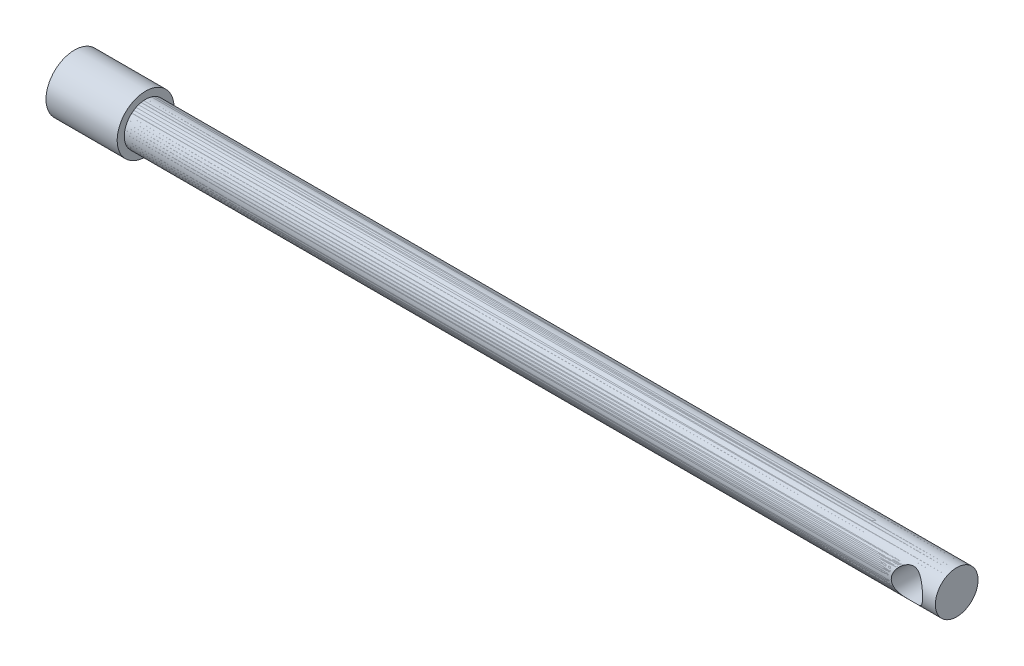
ISO-10303-21;
HEADER;
FILE_DESCRIPTION(('STEP AP214'),'2;1');
FILE_NAME('part.step','',(''),(''),'','','');
FILE_SCHEMA(('AUTOMOTIVE_DESIGN { 1 0 10303 214 1 1 1 1 }'));
ENDSEC;
DATA;
#1=APPLICATION_CONTEXT('core data for automotive mechanical design processes');
#2=APPLICATION_PROTOCOL_DEFINITION('international standard','automotive_design',2000,#1);
#3=PRODUCT_CONTEXT('',#1,'mechanical');
#4=PRODUCT('Part','Part','',(#3));
#5=PRODUCT_RELATED_PRODUCT_CATEGORY('part','',(#4));
#6=PRODUCT_DEFINITION_FORMATION('','',#4);
#7=PRODUCT_DEFINITION_CONTEXT('part definition',#1,'design');
#8=PRODUCT_DEFINITION('design','',#6,#7);
#9=PRODUCT_DEFINITION_SHAPE('','',#8);
#10=(LENGTH_UNIT() NAMED_UNIT(*) SI_UNIT(.MILLI.,.METRE.));
#11=(NAMED_UNIT(*) PLANE_ANGLE_UNIT() SI_UNIT($,.RADIAN.));
#12=(NAMED_UNIT(*) SI_UNIT($,.STERADIAN.) SOLID_ANGLE_UNIT());
#13=UNCERTAINTY_MEASURE_WITH_UNIT(LENGTH_MEASURE(1.E-05),#10,'distance_accuracy_value','');
#14=(GEOMETRIC_REPRESENTATION_CONTEXT(3) GLOBAL_UNCERTAINTY_ASSIGNED_CONTEXT((#13)) GLOBAL_UNIT_ASSIGNED_CONTEXT((#10,
#11,#12)) REPRESENTATION_CONTEXT('',''));
#15=CARTESIAN_POINT('',(0.,0.,0.));
#16=DIRECTION('',(0.,0.,1.));
#17=DIRECTION('',(1.,0.,0.));
#18=AXIS2_PLACEMENT_3D('',#15,#16,#17);
#19=CARTESIAN_POINT('',(20.0000000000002,0.,0.));
#20=DIRECTION('',(-1.,0.,0.));
#21=DIRECTION('',(0.,0.,1.));
#22=AXIS2_PLACEMENT_3D('',#19,#20,#21);
#23=CYLINDRICAL_SURFACE('',#22,15.);
#24=CARTESIAN_POINT('',(20.0000000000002,0.,0.));
#25=DIRECTION('',(-1.,0.,0.));
#26=DIRECTION('',(0.,0.,1.));
#27=AXIS2_PLACEMENT_3D('',#24,#25,#26);
#28=CIRCLE('',#27,15.);
#29=CARTESIAN_POINT('',(20.0000000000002,0.,15.));
#30=VERTEX_POINT('',#29);
#31=EDGE_CURVE('P0_E37',#30,#30,#28,.T.);
#32=ORIENTED_EDGE('',*,*,#31,.T.);
#33=EDGE_LOOP('',(#32));
#34=FACE_BOUND('',#33,.T.);
#35=CARTESIAN_POINT('',(-10.9999999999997,0.,15.));
#36=CARTESIAN_POINT('',(-10.9999989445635,0.270234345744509,14.9999989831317));
#37=CARTESIAN_POINT('',(-10.9900265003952,0.5404852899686,14.9926814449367));
#38=CARTESIAN_POINT('',(-10.9502959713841,1.07885095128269,14.963582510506));
#39=CARTESIAN_POINT('',(-10.9205289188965,1.34696464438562,14.9417945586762));
#40=CARTESIAN_POINT('',(-10.8416275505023,1.87926318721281,14.8842251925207));
#41=CARTESIAN_POINT('',(-10.792460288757,2.14344055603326,14.848419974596));
#42=CARTESIAN_POINT('',(-10.6755308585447,2.66544248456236,14.7636492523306));
#43=CARTESIAN_POINT('',(-10.6077705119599,2.92326766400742,14.7146850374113));
#44=CARTESIAN_POINT('',(-10.455056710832,3.42947281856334,14.6049788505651));
#45=CARTESIAN_POINT('',(-10.3702054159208,3.67789896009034,14.5443069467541));
#46=CARTESIAN_POINT('',(-10.1841148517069,4.16556445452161,14.4122135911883));
#47=CARTESIAN_POINT('',(-10.0828752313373,4.40480361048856,14.3407919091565));
#48=CARTESIAN_POINT('',(-9.8651391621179,4.87295052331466,14.1885487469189));
#49=CARTESIAN_POINT('',(-9.74865018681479,5.10186326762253,14.1077318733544));
#50=CARTESIAN_POINT('',(-9.50137535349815,5.54879477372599,13.9380072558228));
#51=CARTESIAN_POINT('',(-9.37058417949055,5.7668094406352,13.8490965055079));
#52=CARTESIAN_POINT('',(-9.08316785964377,6.2106513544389,13.6561916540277));
#53=CARTESIAN_POINT('',(-8.92527466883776,6.43538044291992,13.5515613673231));
#54=CARTESIAN_POINT('',(-8.59474679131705,6.87058994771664,13.3361895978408));
#55=CARTESIAN_POINT('',(-8.42211168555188,7.08106995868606,13.2254479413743));
#56=CARTESIAN_POINT('',(-8.06272673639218,7.48773584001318,12.9995381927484));
#57=CARTESIAN_POINT('',(-7.87595550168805,7.68389912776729,12.8843635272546));
#58=CARTESIAN_POINT('',(-7.48928883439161,8.06123556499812,12.6517037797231));
#59=CARTESIAN_POINT('',(-7.28939585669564,8.24241150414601,12.5342191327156));
#60=CARTESIAN_POINT('',(-6.83682363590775,8.62331346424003,12.2760403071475));
#61=CARTESIAN_POINT('',(-6.5814400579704,8.81979231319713,12.1352768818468));
#62=CARTESIAN_POINT('',(-6.05311944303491,9.19042440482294,11.8570571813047));
#63=CARTESIAN_POINT('',(-5.78017736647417,9.36457119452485,11.7196018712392));
#64=CARTESIAN_POINT('',(-5.21744212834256,9.68936187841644,11.4525286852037));
#65=CARTESIAN_POINT('',(-4.92766801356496,9.84003165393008,11.3229022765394));
#66=CARTESIAN_POINT('',(-4.33141573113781,10.1166556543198,11.0764421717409));
#67=CARTESIAN_POINT('',(-4.02494703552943,10.242623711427,10.9596013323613));
#68=CARTESIAN_POINT('',(-3.50094853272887,10.4303850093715,10.7804394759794));
#69=CARTESIAN_POINT('',(-3.2878225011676,10.499573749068,10.7129270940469));
#70=CARTESIAN_POINT('',(-2.85500800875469,10.6254264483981,10.5881143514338));
#71=CARTESIAN_POINT('',(-2.63532164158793,10.6820943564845,10.5308107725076));
#72=CARTESIAN_POINT('',(-2.19056026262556,10.7820819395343,10.4284147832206));
#73=CARTESIAN_POINT('',(-1.96549609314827,10.8254263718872,10.3832997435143));
#74=CARTESIAN_POINT('',(-1.51077883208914,10.8981901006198,10.3069029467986));
#75=CARTESIAN_POINT('',(-1.28112576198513,10.9276094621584,10.2756211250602));
#76=CARTESIAN_POINT('',(-0.817016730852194,10.9721120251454,10.228090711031));
#77=CARTESIAN_POINT('',(-0.582537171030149,10.9870802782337,10.2119626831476));
#78=CARTESIAN_POINT('',(-0.112548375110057,11.0019364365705,10.1959559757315));
#79=CARTESIAN_POINT('',(0.122960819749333,11.0018249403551,10.1960766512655));
#80=CARTESIAN_POINT('',(0.593049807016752,10.9865203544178,10.2125654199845));
#81=CARTESIAN_POINT('',(0.827628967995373,10.9713183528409,10.2289431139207));
#82=CARTESIAN_POINT('',(1.29374843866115,10.9261645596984,10.2771594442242));
#83=CARTESIAN_POINT('',(1.52528840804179,10.8962111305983,10.3089997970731));
#84=CARTESIAN_POINT('',(2.00856310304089,10.8181280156,10.3909399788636));
#85=CARTESIAN_POINT('',(2.25976351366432,10.7683789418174,10.4426460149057));
#86=CARTESIAN_POINT('',(2.75472374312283,10.6525201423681,10.5608080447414));
#87=CARTESIAN_POINT('',(2.99848250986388,10.5864081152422,10.6272661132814));
#88=CARTESIAN_POINT('',(3.71799960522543,10.3647718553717,10.8450088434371));
#89=CARTESIAN_POINT('',(4.18133061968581,10.1860595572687,11.0145361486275));
#90=CARTESIAN_POINT('',(4.92554456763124,9.84116811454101,11.3219366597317));
#91=CARTESIAN_POINT('',(5.21682114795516,9.68975954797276,11.4522158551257));
#92=CARTESIAN_POINT('',(5.78225957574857,9.36333004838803,11.7206082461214));
#93=CARTESIAN_POINT('',(6.0564158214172,9.18830144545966,11.8587239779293));
#94=CARTESIAN_POINT('',(6.58728128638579,8.8155015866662,12.1384232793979));
#95=CARTESIAN_POINT('',(6.84397449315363,8.61770989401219,12.2800098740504));
#96=CARTESIAN_POINT('',(7.33908375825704,8.20016329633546,12.562678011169));
#97=CARTESIAN_POINT('',(7.57750193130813,7.98041093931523,12.7037596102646));
#98=CARTESIAN_POINT('',(8.0383654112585,7.51619216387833,12.9838893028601));
#99=CARTESIAN_POINT('',(8.260540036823,7.27142254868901,13.1228811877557));
#100=CARTESIAN_POINT('',(8.68379183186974,6.76031353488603,13.3933474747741));
#101=CARTESIAN_POINT('',(8.88486659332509,6.49397168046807,13.5248210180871));
#102=CARTESIAN_POINT('',(9.26374282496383,5.94097811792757,13.7766812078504));
#103=CARTESIAN_POINT('',(9.44158119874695,5.65435975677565,13.8970853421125));
#104=CARTESIAN_POINT('',(9.77210478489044,5.061715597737,14.1237235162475));
#105=CARTESIAN_POINT('',(9.92480016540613,4.75569771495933,14.2299632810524));
#106=CARTESIAN_POINT('',(10.167112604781,4.20659794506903,14.4001660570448));
#107=CARTESIAN_POINT('',(10.2628788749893,3.96740850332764,14.4679959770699));
#108=CARTESIAN_POINT('',(10.4380921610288,3.48039642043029,14.5928058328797));
#109=CARTESIAN_POINT('',(10.5175428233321,3.23257572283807,14.649788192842));
#110=CARTESIAN_POINT('',(10.659004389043,2.73012906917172,14.7516769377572));
#111=CARTESIAN_POINT('',(10.7210502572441,2.47551789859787,14.7966075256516));
#112=CARTESIAN_POINT('',(10.8270300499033,1.96072320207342,14.8735755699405));
#113=CARTESIAN_POINT('',(10.8709713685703,1.70054199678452,14.9056182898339));
#114=CARTESIAN_POINT('',(10.9368839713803,1.20084572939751,14.953761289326));
#115=CARTESIAN_POINT('',(10.9605217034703,0.961665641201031,14.9710694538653));
#116=CARTESIAN_POINT('',(10.9920819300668,0.481661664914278,14.994190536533));
#117=CARTESIAN_POINT('',(11.0000009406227,0.240837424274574,15.0000009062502));
#118=CARTESIAN_POINT('',(10.999998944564,-0.270234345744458,14.9999989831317));
#119=CARTESIAN_POINT('',(10.9900265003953,-0.540485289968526,14.9926814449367));
#120=CARTESIAN_POINT('',(10.9502959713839,-1.0788509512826,14.963582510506));
#121=CARTESIAN_POINT('',(10.9205289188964,-1.34696464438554,14.9417945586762));
#122=CARTESIAN_POINT('',(10.8416275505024,-1.87926318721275,14.8842251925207));
#123=CARTESIAN_POINT('',(10.7924602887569,-2.1434405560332,14.8484199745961));
#124=CARTESIAN_POINT('',(10.6755308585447,-2.66544248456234,14.7636492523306));
#125=CARTESIAN_POINT('',(10.6077705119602,-2.92326766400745,14.7146850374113));
#126=CARTESIAN_POINT('',(10.4550567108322,-3.42947281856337,14.6049788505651));
#127=CARTESIAN_POINT('',(10.3702054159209,-3.67789896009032,14.5443069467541));
#128=CARTESIAN_POINT('',(10.1841148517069,-4.16556445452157,14.4122135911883));
#129=CARTESIAN_POINT('',(10.0828752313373,-4.40480361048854,14.3407919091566));
#130=CARTESIAN_POINT('',(9.86513916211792,-4.87295052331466,14.1885487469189));
#131=CARTESIAN_POINT('',(9.7486501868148,-5.10186326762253,14.1077318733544));
#132=CARTESIAN_POINT('',(9.50137535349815,-5.54879477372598,13.9380072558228));
#133=CARTESIAN_POINT('',(9.37058417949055,-5.76680944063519,13.8490965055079));
#134=CARTESIAN_POINT('',(9.08316785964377,-6.2106513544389,13.6561916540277));
#135=CARTESIAN_POINT('',(8.92527466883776,-6.43538044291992,13.5515613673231));
#136=CARTESIAN_POINT('',(8.59474679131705,-6.87058994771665,13.3361895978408));
#137=CARTESIAN_POINT('',(8.42211168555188,-7.08106995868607,13.2254479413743));
#138=CARTESIAN_POINT('',(8.06272673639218,-7.48773584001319,12.9995381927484));
#139=CARTESIAN_POINT('',(7.87595550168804,-7.6838991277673,12.8843635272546));
#140=CARTESIAN_POINT('',(7.4892888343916,-8.06123556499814,12.6517037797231));
#141=CARTESIAN_POINT('',(7.28939585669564,-8.24241150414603,12.5342191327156));
#142=CARTESIAN_POINT('',(6.83682363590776,-8.62331346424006,12.2760403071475));
#143=CARTESIAN_POINT('',(6.5814400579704,-8.81979231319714,12.1352768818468));
#144=CARTESIAN_POINT('',(6.05311944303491,-9.19042440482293,11.8570571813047));
#145=CARTESIAN_POINT('',(5.78017736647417,-9.36457119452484,11.7196018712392));
#146=CARTESIAN_POINT('',(5.21744212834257,-9.68936187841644,11.4525286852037));
#147=CARTESIAN_POINT('',(4.92766801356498,-9.84003165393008,11.3229022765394));
#148=CARTESIAN_POINT('',(4.33141573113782,-10.1166556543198,11.0764421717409));
#149=CARTESIAN_POINT('',(4.02494703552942,-10.242623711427,10.9596013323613));
#150=CARTESIAN_POINT('',(3.50094853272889,-10.4303850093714,10.7804394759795));
#151=CARTESIAN_POINT('',(3.28782250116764,-10.4995737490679,10.7129270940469));
#152=CARTESIAN_POINT('',(2.85500800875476,-10.6254264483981,10.5881143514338));
#153=CARTESIAN_POINT('',(2.63532164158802,-10.6820943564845,10.5308107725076));
#154=CARTESIAN_POINT('',(2.19056026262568,-10.7820819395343,10.4284147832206));
#155=CARTESIAN_POINT('',(1.9654960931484,-10.8254263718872,10.3832997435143));
#156=CARTESIAN_POINT('',(1.51077883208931,-10.8981901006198,10.3069029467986));
#157=CARTESIAN_POINT('',(1.28112576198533,-10.9276094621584,10.2756211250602));
#158=CARTESIAN_POINT('',(0.817016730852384,-10.9721120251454,10.228090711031));
#159=CARTESIAN_POINT('',(0.582537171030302,-10.9870802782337,10.2119626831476));
#160=CARTESIAN_POINT('',(0.112548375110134,-11.0019364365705,10.1959559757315));
#161=CARTESIAN_POINT('',(-0.122960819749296,-11.0018249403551,10.1960766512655));
#162=CARTESIAN_POINT('',(-0.593049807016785,-10.9865203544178,10.2125654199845));
#163=CARTESIAN_POINT('',(-0.827628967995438,-10.9713183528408,10.2289431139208));
#164=CARTESIAN_POINT('',(-1.29374843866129,-10.9261645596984,10.2771594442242));
#165=CARTESIAN_POINT('',(-1.52528840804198,-10.8962111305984,10.3089997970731));
#166=CARTESIAN_POINT('',(-2.00856310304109,-10.8181280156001,10.3909399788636));
#167=CARTESIAN_POINT('',(-2.25976351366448,-10.7683789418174,10.4426460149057));
#168=CARTESIAN_POINT('',(-2.75472374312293,-10.652520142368,10.5608080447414));
#169=CARTESIAN_POINT('',(-2.99848250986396,-10.5864081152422,10.6272661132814));
#170=CARTESIAN_POINT('',(-3.71799960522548,-10.3647718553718,10.8450088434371));
#171=CARTESIAN_POINT('',(-4.18133061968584,-10.1860595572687,11.0145361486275));
#172=CARTESIAN_POINT('',(-4.92554456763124,-9.84116811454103,11.3219366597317));
#173=CARTESIAN_POINT('',(-5.21682114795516,-9.68975954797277,11.4522158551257));
#174=CARTESIAN_POINT('',(-5.78225957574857,-9.36333004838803,11.7206082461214));
#175=CARTESIAN_POINT('',(-6.0564158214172,-9.18830144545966,11.8587239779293));
#176=CARTESIAN_POINT('',(-6.58728128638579,-8.81550158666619,12.1384232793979));
#177=CARTESIAN_POINT('',(-6.84397449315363,-8.61770989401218,12.2800098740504));
#178=CARTESIAN_POINT('',(-7.33908375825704,-8.20016329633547,12.5626780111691));
#179=CARTESIAN_POINT('',(-7.57750193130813,-7.98041093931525,12.7037596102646));
#180=CARTESIAN_POINT('',(-8.03836541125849,-7.51619216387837,12.9838893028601));
#181=CARTESIAN_POINT('',(-8.26054003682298,-7.27142254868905,13.1228811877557));
#182=CARTESIAN_POINT('',(-8.68379183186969,-6.76031353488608,13.3933474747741));
#183=CARTESIAN_POINT('',(-8.88486659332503,-6.49397168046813,13.524821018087));
#184=CARTESIAN_POINT('',(-9.2637428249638,-5.94097811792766,13.7766812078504));
#185=CARTESIAN_POINT('',(-9.44158119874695,-5.65435975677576,13.8970853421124));
#186=CARTESIAN_POINT('',(-9.77210478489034,-5.06171559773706,14.1237235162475));
#187=CARTESIAN_POINT('',(-9.92480016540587,-4.75569771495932,14.2299632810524));
#188=CARTESIAN_POINT('',(-10.1671126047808,-4.20659794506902,14.4001660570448));
#189=CARTESIAN_POINT('',(-10.2628788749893,-3.96740850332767,14.4679959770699));
#190=CARTESIAN_POINT('',(-10.4380921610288,-3.48039642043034,14.5928058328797));
#191=CARTESIAN_POINT('',(-10.5175428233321,-3.2325757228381,14.649788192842));
#192=CARTESIAN_POINT('',(-10.659004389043,-2.73012906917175,14.7516769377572));
#193=CARTESIAN_POINT('',(-10.7210502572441,-2.47551789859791,14.7966075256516));
#194=CARTESIAN_POINT('',(-10.8270300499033,-1.96072320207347,14.8735755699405));
#195=CARTESIAN_POINT('',(-10.8709713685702,-1.70054199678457,14.9056182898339));
#196=CARTESIAN_POINT('',(-10.9368839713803,-1.20084572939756,14.953761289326));
#197=CARTESIAN_POINT('',(-10.9605217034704,-0.961665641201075,14.9710694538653));
#198=CARTESIAN_POINT('',(-10.9920819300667,-0.481661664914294,14.994190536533));
#199=CARTESIAN_POINT('',(-11.0000009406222,-0.240837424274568,15.0000009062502));
#200=CARTESIAN_POINT('',(-10.9999999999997,0.,15.));
#201=B_SPLINE_CURVE_WITH_KNOTS('',3,(#35,#36,#37,#38,#39,#40,#41,#42,#43,#44,#45,#46,#47,#48,
#49,#50,#51,#52,#53,#54,#55,#56,#57,#58,#59,#60,#61,#62,#63,#64,#65,#66,#67,#68,#69,#70,#71,#72,
#73,#74,#75,#76,#77,#78,#79,#80,#81,#82,#83,#84,#85,#86,#87,#88,#89,#90,#91,#92,#93,#94,#95,#96,
#97,#98,#99,#100,#101,#102,#103,#104,#105,#106,#107,#108,#109,#110,#111,#112,#113,#114,#115,
#116,#117,#118,#119,#120,#121,#122,#123,#124,#125,#126,#127,#128,#129,#130,#131,#132,#133,#134,
#135,#136,#137,#138,#139,#140,#141,#142,#143,#144,#145,#146,#147,#148,#149,#150,#151,#152,#153,
#154,#155,#156,#157,#158,#159,#160,#161,#162,#163,#164,#165,#166,#167,#168,#169,#170,#171,#172,
#173,#174,#175,#176,#177,#178,#179,#180,#181,#182,#183,#184,#185,#186,#187,#188,#189,#190,#191,
#192,#193,#194,#195,#196,#197,#198,#199,#200),.UNSPECIFIED.,.T.,.F.,(4,2,2,2,2,2,2,2,2,2,2,2,2,
2,2,2,2,2,2,2,2,2,2,2,2,2,2,2,2,2,2,2,2,2,2,2,2,2,2,2,2,2,2,2,2,2,2,2,2,2,2,2,2,2,2,2,2,2,2,2,2,
2,2,2,2,2,2,2,2,2,2,2,2,2,2,2,2,2,2,2,2,2,4),(0.,0.810451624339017,1.62127066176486,
2.43347261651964,3.24559501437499,4.05299986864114,4.86042202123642,5.66744993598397,
6.47477884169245,7.35566894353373,8.23658409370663,9.11886000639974,10.000971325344,
11.0546742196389,12.10868090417,13.1615172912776,14.2137624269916,14.9152774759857,
15.6165709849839,16.3165533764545,17.0165324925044,17.7220346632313,18.4275088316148,
19.1333998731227,19.8393692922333,20.6219293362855,21.4045995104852,22.9719812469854,
24.0304577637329,25.0892788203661,26.1490580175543,27.2087143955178,28.2832214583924,
29.3578510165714,30.4307525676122,31.5032191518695,32.301720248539,33.100042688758,
33.8967496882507,34.6931309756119,35.4152591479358,36.1375473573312,36.9479989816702,
37.7588180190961,38.5710199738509,39.3831423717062,40.1905472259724,40.9979693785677,
41.8049972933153,42.6123261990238,43.493216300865,44.374131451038,45.2564073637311,
46.1385186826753,47.1922215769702,48.2462282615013,49.2990646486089,50.3513097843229,
51.0528248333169,51.7541183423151,52.4541007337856,53.1540798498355,53.8595820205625,
54.5650561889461,55.2709472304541,55.9769166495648,56.759476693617,57.5421468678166,
59.1095286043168,60.1680051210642,61.2268261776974,62.2866053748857,63.3462617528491,
64.4207688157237,65.4953983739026,66.5682999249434,67.6407665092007,68.4392676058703,
69.2375900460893,70.0342970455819,70.8306783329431,71.5528065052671,72.2750947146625),.UNSPECIFIED.);
#202=CARTESIAN_POINT('',(-10.9999999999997,0.,15.));
#203=VERTEX_POINT('',#202);
#204=EDGE_CURVE('P0_E10',#203,#203,#201,.T.);
#205=ORIENTED_EDGE('',*,*,#204,.T.);
#206=EDGE_LOOP('',(#205));
#207=FACE_BOUND('',#206,.T.);
#208=CARTESIAN_POINT('',(11.0000000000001,0.,-15.));
#209=CARTESIAN_POINT('',(10.999998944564,0.270234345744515,-14.9999989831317));
#210=CARTESIAN_POINT('',(10.9900265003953,0.54048528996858,-14.9926814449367));
#211=CARTESIAN_POINT('',(10.9502959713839,1.07885095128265,-14.963582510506));
#212=CARTESIAN_POINT('',(10.9205289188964,1.34696464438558,-14.9417945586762));
#213=CARTESIAN_POINT('',(10.8416275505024,1.87926318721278,-14.8842251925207));
#214=CARTESIAN_POINT('',(10.7924602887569,2.14344055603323,-14.848419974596));
#215=CARTESIAN_POINT('',(10.6755308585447,2.66544248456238,-14.7636492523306));
#216=CARTESIAN_POINT('',(10.6077705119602,2.92326766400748,-14.7146850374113));
#217=CARTESIAN_POINT('',(10.4550567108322,3.42947281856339,-14.6049788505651));
#218=CARTESIAN_POINT('',(10.3702054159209,3.67789896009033,-14.5443069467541));
#219=CARTESIAN_POINT('',(10.1841148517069,4.16556445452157,-14.4122135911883));
#220=CARTESIAN_POINT('',(10.0828752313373,4.40480361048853,-14.3407919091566));
#221=CARTESIAN_POINT('',(9.86513916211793,4.87295052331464,-14.1885487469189));
#222=CARTESIAN_POINT('',(9.74865018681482,5.10186326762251,-14.1077318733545));
#223=CARTESIAN_POINT('',(9.50137535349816,5.54879477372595,-13.9380072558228));
#224=CARTESIAN_POINT('',(9.37058417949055,5.76680944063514,-13.8490965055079));
#225=CARTESIAN_POINT('',(9.08316785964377,6.21065135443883,-13.6561916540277));
#226=CARTESIAN_POINT('',(8.92527466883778,6.43538044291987,-13.5515613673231));
#227=CARTESIAN_POINT('',(8.59474679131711,6.87058994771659,-13.3361895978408));
#228=CARTESIAN_POINT('',(8.42211168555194,7.081069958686,-13.2254479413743));
#229=CARTESIAN_POINT('',(8.06272673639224,7.4877358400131,-12.9995381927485));
#230=CARTESIAN_POINT('',(7.8759555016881,7.6838991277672,-12.8843635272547));
#231=CARTESIAN_POINT('',(7.48928883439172,8.06123556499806,-12.6517037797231));
#232=CARTESIAN_POINT('',(7.28939585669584,8.242411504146,-12.5342191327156));
#233=CARTESIAN_POINT('',(6.83682363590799,8.62331346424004,-12.2760403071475));
#234=CARTESIAN_POINT('',(6.58144005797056,8.81979231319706,-12.1352768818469));
#235=CARTESIAN_POINT('',(6.05311944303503,9.19042440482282,-11.8570571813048));
#236=CARTESIAN_POINT('',(5.78017736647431,9.36457119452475,-11.7196018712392));
#237=CARTESIAN_POINT('',(5.21744212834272,9.68936187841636,-11.4525286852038));
#238=CARTESIAN_POINT('',(4.92766801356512,9.84003165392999,-11.3229022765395));
#239=CARTESIAN_POINT('',(4.331415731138,10.1166556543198,-11.076442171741));
#240=CARTESIAN_POINT('',(4.02494703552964,10.242623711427,-10.9596013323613));
#241=CARTESIAN_POINT('',(3.50094853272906,10.4303850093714,-10.7804394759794));
#242=CARTESIAN_POINT('',(3.28782250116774,10.4995737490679,-10.7129270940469));
#243=CARTESIAN_POINT('',(2.85500800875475,10.625426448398,-10.5881143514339));
#244=CARTESIAN_POINT('',(2.63532164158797,10.6820943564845,-10.5308107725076));
#245=CARTESIAN_POINT('',(2.19056026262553,10.7820819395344,-10.4284147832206));
#246=CARTESIAN_POINT('',(1.9654960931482,10.8254263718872,-10.3832997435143));
#247=CARTESIAN_POINT('',(1.51077883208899,10.8981901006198,-10.3069029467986));
#248=CARTESIAN_POINT('',(1.28112576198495,10.9276094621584,-10.2756211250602));
#249=CARTESIAN_POINT('',(0.81701673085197,10.9721120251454,-10.2280907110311));
#250=CARTESIAN_POINT('',(0.582537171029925,10.9870802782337,-10.2119626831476));
#251=CARTESIAN_POINT('',(0.11254837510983,11.0019364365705,-10.1959559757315));
#252=CARTESIAN_POINT('',(-0.122960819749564,11.0018249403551,-10.1960766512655));
#253=CARTESIAN_POINT('',(-0.593049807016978,10.9865203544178,-10.2125654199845));
#254=CARTESIAN_POINT('',(-0.827628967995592,10.9713183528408,-10.2289431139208));
#255=CARTESIAN_POINT('',(-1.29374843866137,10.9261645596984,-10.2771594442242));
#256=CARTESIAN_POINT('',(-1.52528840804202,10.8962111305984,-10.3089997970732));
#257=CARTESIAN_POINT('',(-2.00856310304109,10.8181280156,-10.3909399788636));
#258=CARTESIAN_POINT('',(-2.25976351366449,10.7683789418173,-10.4426460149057));
#259=CARTESIAN_POINT('',(-2.75472374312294,10.652520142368,-10.5608080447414));
#260=CARTESIAN_POINT('',(-2.99848250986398,10.5864081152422,-10.6272661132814));
#261=CARTESIAN_POINT('',(-3.71799960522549,10.3647718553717,-10.8450088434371));
#262=CARTESIAN_POINT('',(-4.18133061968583,10.1860595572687,-11.0145361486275));
#263=CARTESIAN_POINT('',(-4.92554456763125,9.84116811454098,-11.3219366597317));
#264=CARTESIAN_POINT('',(-5.21682114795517,9.68975954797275,-11.4522158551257));
#265=CARTESIAN_POINT('',(-5.78225957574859,9.36333004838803,-11.7206082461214));
#266=CARTESIAN_POINT('',(-6.05641582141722,9.18830144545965,-11.8587239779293));
#267=CARTESIAN_POINT('',(-6.58728128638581,8.81550158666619,-12.1384232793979));
#268=CARTESIAN_POINT('',(-6.84397449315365,8.61770989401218,-12.2800098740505));
#269=CARTESIAN_POINT('',(-7.33908375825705,8.20016329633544,-12.5626780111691));
#270=CARTESIAN_POINT('',(-7.57750193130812,7.98041093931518,-12.7037596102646));
#271=CARTESIAN_POINT('',(-8.0383654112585,7.51619216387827,-12.9838893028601));
#272=CARTESIAN_POINT('',(-8.26054003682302,7.27142254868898,-13.1228811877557));
#273=CARTESIAN_POINT('',(-8.68379183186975,6.76031353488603,-13.3933474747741));
#274=CARTESIAN_POINT('',(-8.88486659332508,6.49397168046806,-13.5248210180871));
#275=CARTESIAN_POINT('',(-9.26374282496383,5.94097811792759,-13.7766812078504));
#276=CARTESIAN_POINT('',(-9.44158119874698,5.65435975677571,-13.8970853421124));
#277=CARTESIAN_POINT('',(-9.77210478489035,5.06171559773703,-14.1237235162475));
#278=CARTESIAN_POINT('',(-9.92480016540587,4.75569771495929,-14.2299632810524));
#279=CARTESIAN_POINT('',(-10.1671126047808,4.20659794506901,-14.4001660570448));
#280=CARTESIAN_POINT('',(-10.2628788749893,3.96740850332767,-14.4679959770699));
#281=CARTESIAN_POINT('',(-10.4380921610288,3.48039642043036,-14.5928058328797));
#282=CARTESIAN_POINT('',(-10.5175428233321,3.23257572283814,-14.649788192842));
#283=CARTESIAN_POINT('',(-10.659004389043,2.73012906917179,-14.7516769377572));
#284=CARTESIAN_POINT('',(-10.7210502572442,2.47551789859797,-14.7966075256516));
#285=CARTESIAN_POINT('',(-10.8270300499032,1.96072320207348,-14.8735755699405));
#286=CARTESIAN_POINT('',(-10.8709713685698,1.70054199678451,-14.9056182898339));
#287=CARTESIAN_POINT('',(-10.9368839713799,1.20084572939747,-14.953761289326));
#288=CARTESIAN_POINT('',(-10.9605217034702,0.961665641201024,-14.9710694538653));
#289=CARTESIAN_POINT('',(-10.9920819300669,0.481661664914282,-14.994190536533));
#290=CARTESIAN_POINT('',(-11.0000009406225,0.24083742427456,-15.0000009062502));
#291=CARTESIAN_POINT('',(-10.9999989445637,-0.270234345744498,-14.9999989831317));
#292=CARTESIAN_POINT('',(-10.9900265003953,-0.540485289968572,-14.9926814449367));
#293=CARTESIAN_POINT('',(-10.950295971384,-1.07885095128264,-14.963582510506));
#294=CARTESIAN_POINT('',(-10.9205289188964,-1.34696464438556,-14.9417945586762));
#295=CARTESIAN_POINT('',(-10.8416275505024,-1.87926318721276,-14.8842251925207));
#296=CARTESIAN_POINT('',(-10.792460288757,-2.14344055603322,-14.8484199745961));
#297=CARTESIAN_POINT('',(-10.6755308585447,-2.66544248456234,-14.7636492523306));
#298=CARTESIAN_POINT('',(-10.6077705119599,-2.92326766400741,-14.7146850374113));
#299=CARTESIAN_POINT('',(-10.455056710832,-3.42947281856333,-14.6049788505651));
#300=CARTESIAN_POINT('',(-10.3702054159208,-3.67789896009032,-14.5443069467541));
#301=CARTESIAN_POINT('',(-10.184114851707,-4.16556445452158,-14.4122135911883));
#302=CARTESIAN_POINT('',(-10.0828752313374,-4.40480361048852,-14.3407919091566));
#303=CARTESIAN_POINT('',(-9.86513916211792,-4.8729505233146,-14.1885487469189));
#304=CARTESIAN_POINT('',(-9.74865018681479,-5.10186326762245,-14.1077318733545));
#305=CARTESIAN_POINT('',(-9.50137535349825,-5.5487947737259,-13.9380072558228));
#306=CARTESIAN_POINT('',(-9.37058417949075,-5.76680944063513,-13.8490965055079));
#307=CARTESIAN_POINT('',(-9.08316785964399,-6.21065135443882,-13.6561916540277));
#308=CARTESIAN_POINT('',(-8.92527466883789,-6.43538044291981,-13.5515613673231));
#309=CARTESIAN_POINT('',(-8.5947467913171,-6.87058994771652,-13.3361895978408));
#310=CARTESIAN_POINT('',(-8.42211168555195,-7.08106995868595,-13.2254479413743));
#311=CARTESIAN_POINT('',(-8.06272673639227,-7.48773584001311,-12.9995381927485));
#312=CARTESIAN_POINT('',(-7.87595550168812,-7.68389912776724,-12.8843635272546));
#313=CARTESIAN_POINT('',(-7.48928883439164,-8.06123556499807,-12.6517037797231));
#314=CARTESIAN_POINT('',(-7.28939585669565,-8.24241150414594,-12.5342191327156));
#315=CARTESIAN_POINT('',(-6.83682363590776,-8.62331346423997,-12.2760403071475));
#316=CARTESIAN_POINT('',(-6.58144005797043,-8.81979231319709,-12.1352768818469));
#317=CARTESIAN_POINT('',(-6.05311944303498,-9.19042440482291,-11.8570571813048));
#318=CARTESIAN_POINT('',(-5.78017736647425,-9.36457119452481,-11.7196018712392));
#319=CARTESIAN_POINT('',(-5.21744212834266,-9.68936187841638,-11.4525286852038));
#320=CARTESIAN_POINT('',(-4.92766801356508,-9.84003165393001,-11.3229022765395));
#321=CARTESIAN_POINT('',(-4.33141573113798,-10.1166556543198,-11.076442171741));
#322=CARTESIAN_POINT('',(-4.02494703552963,-10.242623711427,-10.9596013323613));
#323=CARTESIAN_POINT('',(-3.50094853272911,-10.4303850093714,-10.7804394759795));
#324=CARTESIAN_POINT('',(-3.28782250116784,-10.4995737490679,-10.7129270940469));
#325=CARTESIAN_POINT('',(-2.85500800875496,-10.625426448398,-10.5881143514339));
#326=CARTESIAN_POINT('',(-2.63532164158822,-10.6820943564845,-10.5308107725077));
#327=CARTESIAN_POINT('',(-2.1905602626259,-10.7820819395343,-10.4284147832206));
#328=CARTESIAN_POINT('',(-1.96549609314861,-10.8254263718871,-10.3832997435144));
#329=CARTESIAN_POINT('',(-1.51077883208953,-10.8981901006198,-10.3069029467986));
#330=CARTESIAN_POINT('',(-1.28112576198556,-10.9276094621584,-10.2756211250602));
#331=CARTESIAN_POINT('',(-0.817016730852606,-10.9721120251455,-10.228090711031));
#332=CARTESIAN_POINT('',(-0.582537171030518,-10.9870802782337,-10.2119626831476));
#333=CARTESIAN_POINT('',(-0.112548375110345,-11.0019364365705,-10.1959559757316));
#334=CARTESIAN_POINT('',(0.122960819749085,-11.0018249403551,-10.1960766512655));
#335=CARTESIAN_POINT('',(0.593049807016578,-10.9865203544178,-10.2125654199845));
#336=CARTESIAN_POINT('',(0.827628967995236,-10.9713183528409,-10.2289431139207));
#337=CARTESIAN_POINT('',(1.29374843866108,-10.9261645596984,-10.2771594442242));
#338=CARTESIAN_POINT('',(1.52528840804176,-10.8962111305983,-10.3089997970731));
#339=CARTESIAN_POINT('',(2.00856310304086,-10.8181280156,-10.3909399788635));
#340=CARTESIAN_POINT('',(2.25976351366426,-10.7683789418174,-10.4426460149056));
#341=CARTESIAN_POINT('',(2.75472374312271,-10.6525201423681,-10.5608080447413));
#342=CARTESIAN_POINT('',(2.99848250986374,-10.5864081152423,-10.6272661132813));
#343=CARTESIAN_POINT('',(3.71799960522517,-10.3647718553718,-10.8450088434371));
#344=CARTESIAN_POINT('',(4.18133061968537,-10.1860595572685,-11.0145361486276));
#345=CARTESIAN_POINT('',(4.92554456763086,-9.84116811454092,-11.3219366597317));
#346=CARTESIAN_POINT('',(5.21682114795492,-9.68975954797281,-11.4522158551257));
#347=CARTESIAN_POINT('',(5.78225957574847,-9.36333004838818,-11.7206082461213));
#348=CARTESIAN_POINT('',(6.05641582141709,-9.18830144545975,-11.8587239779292));
#349=CARTESIAN_POINT('',(6.5872812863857,-8.81550158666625,-12.1384232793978));
#350=CARTESIAN_POINT('',(6.84397449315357,-8.61770989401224,-12.2800098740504));
#351=CARTESIAN_POINT('',(7.33908375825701,-8.20016329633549,-12.562678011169));
#352=CARTESIAN_POINT('',(7.57750193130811,-7.98041093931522,-12.7037596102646));
#353=CARTESIAN_POINT('',(8.0383654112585,-7.5161921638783,-12.9838893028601));
#354=CARTESIAN_POINT('',(8.26054003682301,-7.271422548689,-13.1228811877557));
#355=CARTESIAN_POINT('',(8.68379183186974,-6.76031353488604,-13.3933474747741));
#356=CARTESIAN_POINT('',(8.88486659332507,-6.49397168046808,-13.5248210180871));
#357=CARTESIAN_POINT('',(9.26374282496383,-5.94097811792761,-13.7766812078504));
#358=CARTESIAN_POINT('',(9.44158119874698,-5.65435975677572,-13.8970853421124));
#359=CARTESIAN_POINT('',(9.77210478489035,-5.06171559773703,-14.1237235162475));
#360=CARTESIAN_POINT('',(9.92480016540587,-4.75569771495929,-14.2299632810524));
#361=CARTESIAN_POINT('',(10.1671126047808,-4.20659794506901,-14.4001660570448));
#362=CARTESIAN_POINT('',(10.2628788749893,-3.96740850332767,-14.4679959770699));
#363=CARTESIAN_POINT('',(10.4380921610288,-3.48039642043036,-14.5928058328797));
#364=CARTESIAN_POINT('',(10.5175428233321,-3.23257572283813,-14.649788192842));
#365=CARTESIAN_POINT('',(10.659004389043,-2.73012906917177,-14.7516769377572));
#366=CARTESIAN_POINT('',(10.7210502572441,-2.47551789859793,-14.7966075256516));
#367=CARTESIAN_POINT('',(10.8270300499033,-1.96072320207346,-14.8735755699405));
#368=CARTESIAN_POINT('',(10.87097136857,-1.70054199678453,-14.9056182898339));
#369=CARTESIAN_POINT('',(10.9368839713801,-1.20084572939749,-14.953761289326));
#370=CARTESIAN_POINT('',(10.9605217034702,-0.961665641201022,-14.9710694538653));
#371=CARTESIAN_POINT('',(10.9920819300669,-0.481661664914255,-14.994190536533));
#372=CARTESIAN_POINT('',(11.0000009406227,-0.240837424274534,-15.0000009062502));
#373=CARTESIAN_POINT('',(11.0000000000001,0.,-15.));
#374=B_SPLINE_CURVE_WITH_KNOTS('',3,(#208,#209,#210,#211,#212,#213,#214,#215,#216,#217,#218,
#219,#220,#221,#222,#223,#224,#225,#226,#227,#228,#229,#230,#231,#232,#233,#234,#235,#236,#237,
#238,#239,#240,#241,#242,#243,#244,#245,#246,#247,#248,#249,#250,#251,#252,#253,#254,#255,#256,
#257,#258,#259,#260,#261,#262,#263,#264,#265,#266,#267,#268,#269,#270,#271,#272,#273,#274,#275,
#276,#277,#278,#279,#280,#281,#282,#283,#284,#285,#286,#287,#288,#289,#290,#291,#292,#293,#294,
#295,#296,#297,#298,#299,#300,#301,#302,#303,#304,#305,#306,#307,#308,#309,#310,#311,#312,#313,
#314,#315,#316,#317,#318,#319,#320,#321,#322,#323,#324,#325,#326,#327,#328,#329,#330,#331,#332,
#333,#334,#335,#336,#337,#338,#339,#340,#341,#342,#343,#344,#345,#346,#347,#348,#349,#350,#351,
#352,#353,#354,#355,#356,#357,#358,#359,#360,#361,#362,#363,#364,#365,#366,#367,#368,#369,#370,
#371,#372,#373),.UNSPECIFIED.,.T.,.F.,(4,2,2,2,2,2,2,2,2,2,2,2,2,2,2,2,2,2,2,2,2,2,2,2,2,2,2,2,
2,2,2,2,2,2,2,2,2,2,2,2,2,2,2,2,2,2,2,2,2,2,2,2,2,2,2,2,2,2,2,2,2,2,2,2,2,2,2,2,2,2,2,2,2,2,2,2,
2,2,2,2,2,2,4),(0.,0.810451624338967,1.62127066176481,2.43347261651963,3.24559501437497,
4.05299986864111,4.8604220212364,5.66744993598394,6.47477884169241,7.35566894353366,
8.23658409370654,9.11886000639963,10.0009713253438,11.0546742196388,12.1086809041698,
13.1615172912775,14.2137624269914,14.9152774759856,15.616570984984,16.3165533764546,
17.0165324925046,17.7220346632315,18.4275088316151,19.133399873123,19.8393692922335,
20.6219293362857,21.4045995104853,22.9719812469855,24.030457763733,25.0892788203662,
26.1490580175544,27.2087143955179,28.2832214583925,29.3578510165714,30.4307525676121,
31.5032191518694,32.301720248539,33.1000426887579,33.8967496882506,34.6931309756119,
35.4152591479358,36.1375473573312,36.9479989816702,37.758818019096,38.5710199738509,
39.3831423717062,40.1905472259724,40.9979693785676,41.8049972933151,42.6123261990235,
43.4932163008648,44.3741314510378,45.2564073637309,46.1385186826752,47.1922215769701,
48.2462282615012,49.2990646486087,50.3513097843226,51.0528248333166,51.7541183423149,
52.4541007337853,53.1540798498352,53.8595820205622,54.5650561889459,55.2709472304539,
55.9769166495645,56.7594766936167,57.5421468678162,59.1095286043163,60.1680051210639,
61.2268261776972,62.2866053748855,63.3462617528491,64.4207688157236,65.4953983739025,
66.5682999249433,67.6407665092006,68.4392676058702,69.2375900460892,70.0342970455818,
70.8306783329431,71.5528065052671,72.2750947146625),.UNSPECIFIED.);
#375=CARTESIAN_POINT('',(11.0000000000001,0.,-15.));
#376=VERTEX_POINT('',#375);
#377=EDGE_CURVE('P0_E32',#376,#376,#374,.T.);
#378=ORIENTED_EDGE('',*,*,#377,.T.);
#379=EDGE_LOOP('',(#378));
#380=FACE_BOUND('',#379,.T.);
#381=CARTESIAN_POINT('',(-550.,0.,0.));
#382=DIRECTION('',(-1.,0.,0.));
#383=DIRECTION('',(0.,0.,1.));
#384=AXIS2_PLACEMENT_3D('',#381,#382,#383);
#385=CIRCLE('',#384,15.);
#386=CARTESIAN_POINT('',(-550.,0.,15.));
#387=VERTEX_POINT('',#386);
#388=EDGE_CURVE('P0_E28',#387,#387,#385,.F.);
#389=ORIENTED_EDGE('',*,*,#388,.T.);
#390=EDGE_LOOP('',(#389));
#391=FACE_BOUND('',#390,.T.);
#392=ADVANCED_FACE('P0_F24',(#34,#207,#380,#391),#23,.T.);
#393=CARTESIAN_POINT('',(20.0000000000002,0.,0.));
#394=DIRECTION('',(1.,0.,0.));
#395=DIRECTION('',(0.,0.,-1.));
#396=AXIS2_PLACEMENT_3D('',#393,#394,#395);
#397=PLANE('',#396);
#398=ORIENTED_EDGE('',*,*,#31,.F.);
#399=EDGE_LOOP('',(#398));
#400=FACE_BOUND('',#399,.T.);
#401=ADVANCED_FACE('P0_F51',(#400),#397,.T.);
#402=CARTESIAN_POINT('',(0.,0.,-15.));
#403=DIRECTION('',(0.,0.,1.));
#404=DIRECTION('',(1.,0.,0.));
#405=AXIS2_PLACEMENT_3D('',#402,#403,#404);
#406=CYLINDRICAL_SURFACE('',#405,11.);
#407=ORIENTED_EDGE('',*,*,#377,.F.);
#408=EDGE_LOOP('',(#407));
#409=FACE_BOUND('',#408,.T.);
#410=ORIENTED_EDGE('',*,*,#204,.F.);
#411=EDGE_LOOP('',(#410));
#412=FACE_BOUND('',#411,.T.);
#413=ADVANCED_FACE('P0_F46',(#409,#412),#406,.F.);
#414=CARTESIAN_POINT('',(-550.,0.,0.));
#415=DIRECTION('',(-1.,0.,0.));
#416=DIRECTION('',(0.,0.,1.));
#417=AXIS2_PLACEMENT_3D('',#414,#415,#416);
#418=CYLINDRICAL_SURFACE('',#417,20.);
#419=CARTESIAN_POINT('',(-550.,0.,0.));
#420=DIRECTION('',(-1.,0.,0.));
#421=DIRECTION('',(0.,0.,1.));
#422=AXIS2_PLACEMENT_3D('',#419,#420,#421);
#423=CIRCLE('',#422,20.);
#424=CARTESIAN_POINT('',(-550.,0.,20.));
#425=VERTEX_POINT('',#424);
#426=EDGE_CURVE('P0_E42',#425,#425,#423,.T.);
#427=ORIENTED_EDGE('',*,*,#426,.T.);
#428=EDGE_LOOP('',(#427));
#429=FACE_BOUND('',#428,.T.);
#430=CARTESIAN_POINT('',(-600.,0.,0.));
#431=DIRECTION('',(-1.,0.,0.));
#432=DIRECTION('',(0.,0.,1.));
#433=AXIS2_PLACEMENT_3D('',#430,#431,#432);
#434=CIRCLE('',#433,20.);
#435=CARTESIAN_POINT('',(-600.,0.,20.));
#436=VERTEX_POINT('',#435);
#437=EDGE_CURVE('P0_E83',#436,#436,#434,.T.);
#438=ORIENTED_EDGE('',*,*,#437,.F.);
#439=EDGE_LOOP('',(#438));
#440=FACE_BOUND('',#439,.T.);
#441=ADVANCED_FACE('P0_F50',(#429,#440),#418,.T.);
#442=CARTESIAN_POINT('',(-550.,0.,0.));
#443=DIRECTION('',(-1.,0.,0.));
#444=DIRECTION('',(0.,0.,1.));
#445=AXIS2_PLACEMENT_3D('',#442,#443,#444);
#446=PLANE('',#445);
#447=ORIENTED_EDGE('',*,*,#388,.F.);
#448=EDGE_LOOP('',(#447));
#449=FACE_BOUND('',#448,.T.);
#450=ORIENTED_EDGE('',*,*,#426,.F.);
#451=EDGE_LOOP('',(#450));
#452=FACE_BOUND('',#451,.T.);
#453=ADVANCED_FACE('P0_F57',(#449,#452),#446,.F.);
#454=CARTESIAN_POINT('',(-600.,0.,0.));
#455=DIRECTION('',(1.,0.,0.));
#456=DIRECTION('',(0.,0.,-1.));
#457=AXIS2_PLACEMENT_3D('',#454,#455,#456);
#458=PLANE('',#457);
#459=ORIENTED_EDGE('',*,*,#437,.T.);
#460=EDGE_LOOP('',(#459));
#461=FACE_BOUND('',#460,.T.);
#462=ADVANCED_FACE('P0_F53',(#461),#458,.F.);
#463=CLOSED_SHELL('',(#392,#401,#413,#441,#453,#462));
#464=MANIFOLD_SOLID_BREP('P0_B2',#463);
#465=CARTESIAN_POINT('',(19.9999999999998,0.,0.));
#466=DIRECTION('',(1.,0.,0.));
#467=DIRECTION('',(0.,0.,-1.));
#468=AXIS2_PLACEMENT_3D('',#465,#466,#467);
#469=PLANE('',#468);
#470=CARTESIAN_POINT('',(19.9999999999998,0.,0.));
#471=DIRECTION('',(-1.,0.,0.));
#472=DIRECTION('',(0.,0.,1.));
#473=AXIS2_PLACEMENT_3D('',#470,#471,#472);
#474=CIRCLE('',#473,15.);
#475=CARTESIAN_POINT('',(19.9999999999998,0.,15.));
#476=VERTEX_POINT('',#475);
#477=EDGE_CURVE('P1_E19',#476,#476,#474,.T.);
#478=ORIENTED_EDGE('',*,*,#477,.F.);
#479=EDGE_LOOP('',(#478));
#480=FACE_BOUND('',#479,.T.);
#481=ADVANCED_FACE('P1_F14',(#480),#469,.T.);
#482=CARTESIAN_POINT('',(-600.,0.,0.));
#483=DIRECTION('',(1.,0.,0.));
#484=DIRECTION('',(0.,0.,-1.));
#485=AXIS2_PLACEMENT_3D('',#482,#483,#484);
#486=PLANE('',#485);
#487=CARTESIAN_POINT('',(-600.,0.,0.));
#488=DIRECTION('',(-1.,0.,0.));
#489=DIRECTION('',(0.,0.,1.));
#490=AXIS2_PLACEMENT_3D('',#487,#488,#489);
#491=CIRCLE('',#490,15.);
#492=CARTESIAN_POINT('',(-600.,0.,15.));
#493=VERTEX_POINT('',#492);
#494=EDGE_CURVE('P1_E23',#493,#493,#491,.F.);
#495=ORIENTED_EDGE('',*,*,#494,.F.);
#496=EDGE_LOOP('',(#495));
#497=FACE_BOUND('',#496,.T.);
#498=ADVANCED_FACE('P1_F36',(#497),#486,.F.);
#499=CARTESIAN_POINT('',(0.,0.,-15.));
#500=DIRECTION('',(0.,0.,1.));
#501=DIRECTION('',(1.,0.,0.));
#502=AXIS2_PLACEMENT_3D('',#499,#500,#501);
#503=CYLINDRICAL_SURFACE('',#502,11.);
#504=CARTESIAN_POINT('',(10.9999999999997,0.,-15.));
#505=CARTESIAN_POINT('',(10.9999989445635,0.270234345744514,-14.9999989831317));
#506=CARTESIAN_POINT('',(10.9900265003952,0.540485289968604,-14.9926814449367));
#507=CARTESIAN_POINT('',(10.9502959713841,1.07885095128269,-14.963582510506));
#508=CARTESIAN_POINT('',(10.9205289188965,1.34696464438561,-14.9417945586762));
#509=CARTESIAN_POINT('',(10.8416275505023,1.87926318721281,-14.8842251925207));
#510=CARTESIAN_POINT('',(10.792460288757,2.14344055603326,-14.848419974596));
#511=CARTESIAN_POINT('',(10.6755308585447,2.66544248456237,-14.7636492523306));
#512=CARTESIAN_POINT('',(10.6077705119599,2.92326766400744,-14.7146850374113));
#513=CARTESIAN_POINT('',(10.455056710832,3.42947281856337,-14.6049788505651));
#514=CARTESIAN_POINT('',(10.3702054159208,3.67789896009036,-14.5443069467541));
#515=CARTESIAN_POINT('',(10.1841148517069,4.16556445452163,-14.4122135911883));
#516=CARTESIAN_POINT('',(10.0828752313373,4.40480361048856,-14.3407919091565));
#517=CARTESIAN_POINT('',(9.86513916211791,4.87295052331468,-14.1885487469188));
#518=CARTESIAN_POINT('',(9.74865018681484,5.10186326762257,-14.1077318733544));
#519=CARTESIAN_POINT('',(9.5013753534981,5.54879477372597,-13.9380072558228));
#520=CARTESIAN_POINT('',(9.37058417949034,5.76680944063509,-13.8490965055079));
#521=CARTESIAN_POINT('',(9.08316785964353,6.21065135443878,-13.6561916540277));
#522=CARTESIAN_POINT('',(8.92527466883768,6.43538044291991,-13.551561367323));
#523=CARTESIAN_POINT('',(8.5947467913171,6.8705899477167,-13.3361895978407));
#524=CARTESIAN_POINT('',(8.42211168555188,7.08106995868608,-13.2254479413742));
#525=CARTESIAN_POINT('',(8.06272673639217,7.48773584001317,-12.9995381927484));
#526=CARTESIAN_POINT('',(7.87595550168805,7.68389912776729,-12.8843635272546));
#527=CARTESIAN_POINT('',(7.48928883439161,8.06123556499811,-12.6517037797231));
#528=CARTESIAN_POINT('',(7.28939585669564,8.24241150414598,-12.5342191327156));
#529=CARTESIAN_POINT('',(6.83682363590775,8.62331346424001,-12.2760403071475));
#530=CARTESIAN_POINT('',(6.58144005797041,8.81979231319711,-12.1352768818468));
#531=CARTESIAN_POINT('',(6.05311944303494,9.19042440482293,-11.8570571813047));
#532=CARTESIAN_POINT('',(5.78017736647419,9.36457119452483,-11.7196018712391));
#533=CARTESIAN_POINT('',(5.21744212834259,9.68936187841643,-11.4525286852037));
#534=CARTESIAN_POINT('',(4.927668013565,9.84003165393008,-11.3229022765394));
#535=CARTESIAN_POINT('',(4.33141573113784,10.1166556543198,-11.0764421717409));
#536=CARTESIAN_POINT('',(4.02494703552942,10.242623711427,-10.9596013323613));
#537=CARTESIAN_POINT('',(3.50094853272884,10.4303850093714,-10.7804394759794));
#538=CARTESIAN_POINT('',(3.28782250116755,10.499573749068,-10.7129270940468));
#539=CARTESIAN_POINT('',(2.85500800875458,10.6254264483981,-10.5881143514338));
#540=CARTESIAN_POINT('',(2.63532164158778,10.6820943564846,-10.5308107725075));
#541=CARTESIAN_POINT('',(2.19056026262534,10.7820819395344,-10.4284147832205));
#542=CARTESIAN_POINT('',(1.96549609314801,10.8254263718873,-10.3832997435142));
#543=CARTESIAN_POINT('',(1.51077883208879,10.8981901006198,-10.3069029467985));
#544=CARTESIAN_POINT('',(1.28112576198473,10.9276094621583,-10.2756211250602));
#545=CARTESIAN_POINT('',(0.817016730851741,10.9721120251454,-10.2280907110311));
#546=CARTESIAN_POINT('',(0.582537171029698,10.9870802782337,-10.2119626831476));
#547=CARTESIAN_POINT('',(0.112548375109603,11.0019364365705,-10.1959559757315));
#548=CARTESIAN_POINT('',(-0.122960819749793,11.0018249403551,-10.1960766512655));
#549=CARTESIAN_POINT('',(-0.593049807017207,10.9865203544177,-10.2125654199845));
#550=CARTESIAN_POINT('',(-0.827628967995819,10.9713183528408,-10.2289431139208));
#551=CARTESIAN_POINT('',(-1.29374843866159,10.9261645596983,-10.2771594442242));
#552=CARTESIAN_POINT('',(-1.52528840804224,10.8962111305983,-10.3089997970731));
#553=CARTESIAN_POINT('',(-2.0085631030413,10.8181280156,-10.3909399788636));
#554=CARTESIAN_POINT('',(-2.25976351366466,10.7683789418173,-10.4426460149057));
#555=CARTESIAN_POINT('',(-2.75472374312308,10.652520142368,-10.5608080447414));
#556=CARTESIAN_POINT('',(-2.9984825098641,10.5864081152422,-10.6272661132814));
#557=CARTESIAN_POINT('',(-3.71799960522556,10.3647718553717,-10.8450088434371));
#558=CARTESIAN_POINT('',(-4.18133061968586,10.1860595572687,-11.0145361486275));
#559=CARTESIAN_POINT('',(-4.92554456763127,9.84116811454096,-11.3219366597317));
#560=CARTESIAN_POINT('',(-5.21682114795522,9.68975954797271,-11.4522158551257));
#561=CARTESIAN_POINT('',(-5.7822595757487,9.36333004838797,-11.7206082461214));
#562=CARTESIAN_POINT('',(-6.05641582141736,9.18830144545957,-11.8587239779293));
#563=CARTESIAN_POINT('',(-6.58728128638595,8.81550158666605,-12.1384232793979));
#564=CARTESIAN_POINT('',(-6.84397449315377,8.61770989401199,-12.2800098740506));
#565=CARTESIAN_POINT('',(-7.33908375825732,8.20016329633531,-12.5626780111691));
#566=CARTESIAN_POINT('',(-7.57750193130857,7.98041093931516,-12.7037596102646));
#567=CARTESIAN_POINT('',(-8.03836541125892,7.51619216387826,-12.9838893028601));
#568=CARTESIAN_POINT('',(-8.26054003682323,7.27142254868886,-13.1228811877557));
#569=CARTESIAN_POINT('',(-8.6837918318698,6.76031353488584,-13.3933474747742));
#570=CARTESIAN_POINT('',(-8.88486659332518,6.49397168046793,-13.5248210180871));
#571=CARTESIAN_POINT('',(-9.26374282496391,5.94097811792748,-13.7766812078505));
#572=CARTESIAN_POINT('',(-9.441581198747,5.65435975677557,-13.8970853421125));
#573=CARTESIAN_POINT('',(-9.77210478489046,5.06171559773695,-14.1237235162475));
#574=CARTESIAN_POINT('',(-9.92480016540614,4.7556977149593,-14.2299632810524));
#575=CARTESIAN_POINT('',(-10.167112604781,4.20659794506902,-14.4001660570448));
#576=CARTESIAN_POINT('',(-10.2628788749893,3.96740850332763,-14.4679959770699));
#577=CARTESIAN_POINT('',(-10.4380921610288,3.48039642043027,-14.5928058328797));
#578=CARTESIAN_POINT('',(-10.5175428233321,3.23257572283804,-14.649788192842));
#579=CARTESIAN_POINT('',(-10.659004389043,2.73012906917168,-14.7516769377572));
#580=CARTESIAN_POINT('',(-10.7210502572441,2.47551789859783,-14.7966075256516));
#581=CARTESIAN_POINT('',(-10.8270300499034,1.96072320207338,-14.8735755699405));
#582=CARTESIAN_POINT('',(-10.8709713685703,1.70054199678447,-14.9056182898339));
#583=CARTESIAN_POINT('',(-10.9368839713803,1.20084572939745,-14.953761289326));
#584=CARTESIAN_POINT('',(-10.9605217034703,0.96166564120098,-14.9710694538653));
#585=CARTESIAN_POINT('',(-10.9920819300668,0.481661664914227,-14.994190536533));
#586=CARTESIAN_POINT('',(-11.0000009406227,0.240837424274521,-15.0000009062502));
#587=CARTESIAN_POINT('',(-10.999998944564,-0.270234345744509,-14.9999989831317));
#588=CARTESIAN_POINT('',(-10.9900265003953,-0.540485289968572,-14.9926814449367));
#589=CARTESIAN_POINT('',(-10.9502959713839,-1.07885095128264,-14.963582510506));
#590=CARTESIAN_POINT('',(-10.9205289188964,-1.34696464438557,-14.9417945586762));
#591=CARTESIAN_POINT('',(-10.8416275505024,-1.87926318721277,-14.8842251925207));
#592=CARTESIAN_POINT('',(-10.7924602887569,-2.14344055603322,-14.8484199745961));
#593=CARTESIAN_POINT('',(-10.6755308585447,-2.66544248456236,-14.7636492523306));
#594=CARTESIAN_POINT('',(-10.6077705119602,-2.92326766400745,-14.7146850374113));
#595=CARTESIAN_POINT('',(-10.4550567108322,-3.42947281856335,-14.6049788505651));
#596=CARTESIAN_POINT('',(-10.3702054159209,-3.67789896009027,-14.5443069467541));
#597=CARTESIAN_POINT('',(-10.1841148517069,-4.1655644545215,-14.4122135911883));
#598=CARTESIAN_POINT('',(-10.0828752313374,-4.40480361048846,-14.3407919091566));
#599=CARTESIAN_POINT('',(-9.86513916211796,-4.87295052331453,-14.1885487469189));
#600=CARTESIAN_POINT('',(-9.7486501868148,-5.10186326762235,-14.1077318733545));
#601=CARTESIAN_POINT('',(-9.50137535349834,-5.54879477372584,-13.9380072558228));
#602=CARTESIAN_POINT('',(-9.37058417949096,-5.76680944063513,-13.8490965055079));
#603=CARTESIAN_POINT('',(-9.08316785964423,-6.21065135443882,-13.6561916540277));
#604=CARTESIAN_POINT('',(-8.925274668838,-6.43538044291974,-13.5515613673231));
#605=CARTESIAN_POINT('',(-8.59474679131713,-6.87058994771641,-13.3361895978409));
#606=CARTESIAN_POINT('',(-8.42211168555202,-7.08106995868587,-13.2254479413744));
#607=CARTESIAN_POINT('',(-8.06272673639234,-7.48773584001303,-12.9995381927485));
#608=CARTESIAN_POINT('',(-7.87595550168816,-7.68389912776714,-12.8843635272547));
#609=CARTESIAN_POINT('',(-7.48928883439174,-8.06123556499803,-12.6517037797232));
#610=CARTESIAN_POINT('',(-7.28939585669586,-8.24241150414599,-12.5342191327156));
#611=CARTESIAN_POINT('',(-6.83682363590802,-8.62331346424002,-12.2760403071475));
#612=CARTESIAN_POINT('',(-6.5814400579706,-8.81979231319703,-12.1352768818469));
#613=CARTESIAN_POINT('',(-6.05311944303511,-9.19042440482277,-11.8570571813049));
#614=CARTESIAN_POINT('',(-5.78017736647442,-9.3645711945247,-11.7196018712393));
#615=CARTESIAN_POINT('',(-5.21744212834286,-9.68936187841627,-11.4525286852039));
#616=CARTESIAN_POINT('',(-4.92766801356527,-9.84003165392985,-11.3229022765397));
#617=CARTESIAN_POINT('',(-4.33141573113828,-10.1166556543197,-11.076442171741));
#618=CARTESIAN_POINT('',(-4.02494703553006,-10.242623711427,-10.9596013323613));
#619=CARTESIAN_POINT('',(-3.50094853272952,-10.4303850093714,-10.7804394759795));
#620=CARTESIAN_POINT('',(-3.28782250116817,-10.4995737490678,-10.712927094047));
#621=CARTESIAN_POINT('',(-2.85500800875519,-10.6254264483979,-10.588114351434));
#622=CARTESIAN_POINT('',(-2.63532164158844,-10.6820943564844,-10.5308107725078));
#623=CARTESIAN_POINT('',(-2.19056026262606,-10.7820819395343,-10.4284147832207));
#624=CARTESIAN_POINT('',(-1.96549609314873,-10.8254263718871,-10.3832997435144));
#625=CARTESIAN_POINT('',(-1.51077883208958,-10.8981901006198,-10.3069029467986));
#626=CARTESIAN_POINT('',(-1.28112576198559,-10.9276094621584,-10.2756211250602));
#627=CARTESIAN_POINT('',(-0.817016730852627,-10.9721120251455,-10.228090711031));
#628=CARTESIAN_POINT('',(-0.582537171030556,-10.9870802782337,-10.2119626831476));
#629=CARTESIAN_POINT('',(-0.112548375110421,-11.0019364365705,-10.1959559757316));
#630=CARTESIAN_POINT('',(0.122960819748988,-11.0018249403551,-10.1960766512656));
#631=CARTESIAN_POINT('',(0.593049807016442,-10.9865203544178,-10.2125654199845));
#632=CARTESIAN_POINT('',(0.827628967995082,-10.9713183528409,-10.2289431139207));
#633=CARTESIAN_POINT('',(1.29374843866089,-10.9261645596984,-10.2771594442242));
#634=CARTESIAN_POINT('',(1.52528840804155,-10.8962111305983,-10.3089997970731));
#635=CARTESIAN_POINT('',(2.00856310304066,-10.8181280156,-10.3909399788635));
#636=CARTESIAN_POINT('',(2.25976351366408,-10.7683789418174,-10.4426460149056));
#637=CARTESIAN_POINT('',(2.75472374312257,-10.6525201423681,-10.5608080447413));
#638=CARTESIAN_POINT('',(2.99848250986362,-10.5864081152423,-10.6272661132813));
#639=CARTESIAN_POINT('',(3.7179996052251,-10.3647718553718,-10.8450088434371));
#640=CARTESIAN_POINT('',(4.18133061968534,-10.1860595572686,-11.0145361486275));
#641=CARTESIAN_POINT('',(4.92554456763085,-9.84116811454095,-11.3219366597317));
#642=CARTESIAN_POINT('',(5.21682114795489,-9.68975954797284,-11.4522158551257));
#643=CARTESIAN_POINT('',(5.7822595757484,-9.3633300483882,-11.7206082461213));
#644=CARTESIAN_POINT('',(6.05641582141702,-9.18830144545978,-11.8587239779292));
#645=CARTESIAN_POINT('',(6.58728128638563,-8.81550158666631,-12.1384232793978));
#646=CARTESIAN_POINT('',(6.84397449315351,-8.61770989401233,-12.2800098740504));
#647=CARTESIAN_POINT('',(7.33908375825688,-8.20016329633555,-12.562678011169));
#648=CARTESIAN_POINT('',(7.57750193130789,-7.98041093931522,-12.7037596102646));
#649=CARTESIAN_POINT('',(8.03836541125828,-7.5161921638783,-12.9838893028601));
#650=CARTESIAN_POINT('',(8.26054003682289,-7.27142254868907,-13.1228811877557));
#651=CARTESIAN_POINT('',(8.68379183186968,-6.76031353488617,-13.3933474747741));
#652=CARTESIAN_POINT('',(8.88486659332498,-6.4939716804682,-13.524821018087));
#653=CARTESIAN_POINT('',(9.26374282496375,-5.94097811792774,-13.7766812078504));
#654=CARTESIAN_POINT('',(9.44158119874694,-5.65435975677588,-13.8970853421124));
#655=CARTESIAN_POINT('',(9.77210478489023,-5.06171559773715,-14.1237235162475));
#656=CARTESIAN_POINT('',(9.92480016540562,-4.75569771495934,-14.2299632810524));
#657=CARTESIAN_POINT('',(10.1671126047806,-4.20659794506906,-14.4001660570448));
#658=CARTESIAN_POINT('',(10.2628788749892,-3.96740850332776,-14.4679959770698));
#659=CARTESIAN_POINT('',(10.4380921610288,-3.48039642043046,-14.5928058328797));
#660=CARTESIAN_POINT('',(10.517542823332,-3.23257572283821,-14.649788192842));
#661=CARTESIAN_POINT('',(10.659004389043,-2.73012906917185,-14.7516769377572));
#662=CARTESIAN_POINT('',(10.7210502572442,-2.47551789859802,-14.7966075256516));
#663=CARTESIAN_POINT('',(10.8270300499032,-1.96072320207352,-14.8735755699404));
#664=CARTESIAN_POINT('',(10.8709713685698,-1.70054199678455,-14.9056182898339));
#665=CARTESIAN_POINT('',(10.9368839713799,-1.20084572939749,-14.953761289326));
#666=CARTESIAN_POINT('',(10.9605217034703,-0.961665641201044,-14.9710694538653));
#667=CARTESIAN_POINT('',(10.9920819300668,-0.481661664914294,-14.994190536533));
#668=CARTESIAN_POINT('',(11.0000009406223,-0.240837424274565,-15.0000009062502));
#669=CARTESIAN_POINT('',(10.9999999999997,0.,-15.));
#670=B_SPLINE_CURVE_WITH_KNOTS('',3,(#504,#505,#506,#507,#508,#509,#510,#511,#512,#513,#514,
#515,#516,#517,#518,#519,#520,#521,#522,#523,#524,#525,#526,#527,#528,#529,#530,#531,#532,#533,
#534,#535,#536,#537,#538,#539,#540,#541,#542,#543,#544,#545,#546,#547,#548,#549,#550,#551,#552,
#553,#554,#555,#556,#557,#558,#559,#560,#561,#562,#563,#564,#565,#566,#567,#568,#569,#570,#571,
#572,#573,#574,#575,#576,#577,#578,#579,#580,#581,#582,#583,#584,#585,#586,#587,#588,#589,#590,
#591,#592,#593,#594,#595,#596,#597,#598,#599,#600,#601,#602,#603,#604,#605,#606,#607,#608,#609,
#610,#611,#612,#613,#614,#615,#616,#617,#618,#619,#620,#621,#622,#623,#624,#625,#626,#627,#628,
#629,#630,#631,#632,#633,#634,#635,#636,#637,#638,#639,#640,#641,#642,#643,#644,#645,#646,#647,
#648,#649,#650,#651,#652,#653,#654,#655,#656,#657,#658,#659,#660,#661,#662,#663,#664,#665,#666,
#667,#668,#669),.UNSPECIFIED.,.T.,.F.,(4,2,2,2,2,2,2,2,2,2,2,2,2,2,2,2,2,2,2,2,2,2,2,2,2,2,2,2,
2,2,2,2,2,2,2,2,2,2,2,2,2,2,2,2,2,2,2,2,2,2,2,2,2,2,2,2,2,2,2,2,2,2,2,2,2,2,2,2,2,2,2,2,2,2,2,2,
2,2,2,2,2,2,4),(0.,0.81045162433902,1.62127066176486,2.43347261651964,3.24559501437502,
4.05299986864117,4.86042202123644,5.66744993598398,6.47477884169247,7.35566894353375,
8.23658409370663,9.11886000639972,10.000971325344,11.0546742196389,12.10868090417,
13.1615172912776,14.2137624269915,14.9152774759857,15.6165709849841,16.3165533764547,
17.0165324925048,17.7220346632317,18.4275088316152,19.1333998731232,19.8393692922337,
20.6219293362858,21.4045995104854,22.9719812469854,24.030457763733,25.0892788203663,
26.1490580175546,27.2087143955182,28.2832214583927,29.3578510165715,30.4307525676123,
31.5032191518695,32.3017202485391,33.100042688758,33.8967496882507,34.693130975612,
35.4152591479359,36.1375473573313,36.9479989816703,37.7588180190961,38.5710199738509,
39.3831423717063,40.1905472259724,40.9979693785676,41.8049972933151,42.6123261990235,
43.4932163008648,44.3741314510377,45.2564073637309,46.1385186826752,47.19222157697,
48.246228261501,49.2990646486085,50.3513097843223,51.0528248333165,51.7541183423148,
52.4541007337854,53.1540798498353,53.8595820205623,54.5650561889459,55.2709472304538,
55.9769166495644,56.7594766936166,57.5421468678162,59.1095286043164,60.168005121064,
61.2268261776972,62.2866053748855,63.346261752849,64.4207688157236,65.4953983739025,
66.5682999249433,67.6407665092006,68.4392676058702,69.2375900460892,70.0342970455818,
70.8306783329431,71.5528065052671,72.2750947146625),.UNSPECIFIED.);
#671=CARTESIAN_POINT('',(10.9999999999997,0.,-15.));
#672=VERTEX_POINT('',#671);
#673=EDGE_CURVE('P1_E28',#672,#672,#670,.T.);
#674=ORIENTED_EDGE('',*,*,#673,.F.);
#675=EDGE_LOOP('',(#674));
#676=FACE_BOUND('',#675,.T.);
#677=CARTESIAN_POINT('',(-11.0000000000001,0.,15.));
#678=CARTESIAN_POINT('',(-10.999998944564,0.27023434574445,14.9999989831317));
#679=CARTESIAN_POINT('',(-10.9900265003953,0.540485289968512,14.9926814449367));
#680=CARTESIAN_POINT('',(-10.9502959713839,1.07885095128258,14.963582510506));
#681=CARTESIAN_POINT('',(-10.9205289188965,1.34696464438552,14.9417945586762));
#682=CARTESIAN_POINT('',(-10.8416275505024,1.87926318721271,14.8842251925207));
#683=CARTESIAN_POINT('',(-10.7924602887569,2.14344055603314,14.8484199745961));
#684=CARTESIAN_POINT('',(-10.6755308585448,2.66544248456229,14.7636492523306));
#685=CARTESIAN_POINT('',(-10.6077705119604,2.92326766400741,14.7146850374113));
#686=CARTESIAN_POINT('',(-10.4550567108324,3.42947281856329,14.6049788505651));
#687=CARTESIAN_POINT('',(-10.370205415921,3.67789896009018,14.5443069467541));
#688=CARTESIAN_POINT('',(-10.1841148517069,4.16556445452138,14.4122135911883));
#689=CARTESIAN_POINT('',(-10.0828752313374,4.40480361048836,14.3407919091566));
#690=CARTESIAN_POINT('',(-9.86513916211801,4.87295052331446,14.1885487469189));
#691=CARTESIAN_POINT('',(-9.74865018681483,5.10186326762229,14.1077318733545));
#692=CARTESIAN_POINT('',(-9.50137535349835,5.54879477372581,13.9380072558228));
#693=CARTESIAN_POINT('',(-9.37058417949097,5.76680944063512,13.8490965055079));
#694=CARTESIAN_POINT('',(-9.08316785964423,6.21065135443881,13.6561916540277));
#695=CARTESIAN_POINT('',(-8.92527466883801,6.43538044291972,13.5515613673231));
#696=CARTESIAN_POINT('',(-8.59474679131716,6.87058994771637,13.3361895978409));
#697=CARTESIAN_POINT('',(-8.42211168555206,7.08106995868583,13.2254479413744));
#698=CARTESIAN_POINT('',(-8.06272673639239,7.48773584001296,12.9995381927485));
#699=CARTESIAN_POINT('',(-7.8759555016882,7.68389912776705,12.8843635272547));
#700=CARTESIAN_POINT('',(-7.48928883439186,8.06123556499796,12.6517037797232));
#701=CARTESIAN_POINT('',(-7.28939585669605,8.24241150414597,12.5342191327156));
#702=CARTESIAN_POINT('',(-6.83682363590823,8.62331346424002,12.2760403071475));
#703=CARTESIAN_POINT('',(-6.58144005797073,8.81979231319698,12.1352768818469));
#704=CARTESIAN_POINT('',(-6.05311944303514,9.1904244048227,11.8570571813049));
#705=CARTESIAN_POINT('',(-5.78017736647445,9.36457119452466,11.7196018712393));
#706=CARTESIAN_POINT('',(-5.21744212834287,9.68936187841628,11.4525286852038));
#707=CARTESIAN_POINT('',(-4.92766801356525,9.84003165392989,11.3229022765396));
#708=CARTESIAN_POINT('',(-4.33141573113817,10.1166556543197,11.076442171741));
#709=CARTESIAN_POINT('',(-4.02494703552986,10.242623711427,10.9596013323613));
#710=CARTESIAN_POINT('',(-3.5009485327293,10.4303850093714,10.7804394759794));
#711=CARTESIAN_POINT('',(-3.28782250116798,10.4995737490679,10.7129270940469));
#712=CARTESIAN_POINT('',(-2.85500800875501,10.625426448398,10.5881143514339));
#713=CARTESIAN_POINT('',(-2.63532164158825,10.6820943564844,10.5308107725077));
#714=CARTESIAN_POINT('',(-2.19056026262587,10.7820819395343,10.4284147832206));
#715=CARTESIAN_POINT('',(-1.96549609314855,10.8254263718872,10.3832997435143));
#716=CARTESIAN_POINT('',(-1.51077883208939,10.8981901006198,10.3069029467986));
#717=CARTESIAN_POINT('',(-1.28112576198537,10.9276094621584,10.2756211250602));
#718=CARTESIAN_POINT('',(-0.817016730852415,10.9721120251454,10.228090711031));
#719=CARTESIAN_POINT('',(-0.582537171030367,10.9870802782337,10.2119626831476));
#720=CARTESIAN_POINT('',(-0.112548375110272,11.0019364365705,10.1959559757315));
#721=CARTESIAN_POINT('',(0.12296081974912,11.0018249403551,10.1960766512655));
#722=CARTESIAN_POINT('',(0.593049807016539,10.9865203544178,10.2125654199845));
#723=CARTESIAN_POINT('',(0.827628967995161,10.9713183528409,10.2289431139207));
#724=CARTESIAN_POINT('',(1.29374843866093,10.9261645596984,10.2771594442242));
#725=CARTESIAN_POINT('',(1.52528840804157,10.8962111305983,10.3089997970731));
#726=CARTESIAN_POINT('',(2.00856310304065,10.8181280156,10.3909399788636));
#727=CARTESIAN_POINT('',(2.25976351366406,10.7683789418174,10.4426460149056));
#728=CARTESIAN_POINT('',(2.75472374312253,10.6525201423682,10.5608080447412));
#729=CARTESIAN_POINT('',(2.99848250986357,10.5864081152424,10.6272661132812));
#730=CARTESIAN_POINT('',(3.71799960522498,10.3647718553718,10.845008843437));
#731=CARTESIAN_POINT('',(4.18133061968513,10.1860595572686,11.0145361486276));
#732=CARTESIAN_POINT('',(4.92554456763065,9.84116811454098,11.3219366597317));
#733=CARTESIAN_POINT('',(5.21682114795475,9.6897595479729,11.4522158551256));
#734=CARTESIAN_POINT('',(5.78225957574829,9.36333004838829,11.7206082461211));
#735=CARTESIAN_POINT('',(6.05641582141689,9.18830144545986,11.8587239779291));
#736=CARTESIAN_POINT('',(6.58728128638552,8.8155015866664,12.1384232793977));
#737=CARTESIAN_POINT('',(6.84397449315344,8.61770989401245,12.2800098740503));
#738=CARTESIAN_POINT('',(7.33908375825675,8.2001632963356,12.5626780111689));
#739=CARTESIAN_POINT('',(7.57750193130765,7.9804109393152,12.7037596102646));
#740=CARTESIAN_POINT('',(8.03836541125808,7.51619216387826,12.9838893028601));
#741=CARTESIAN_POINT('',(8.26054003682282,7.27142254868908,13.1228811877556));
#742=CARTESIAN_POINT('',(8.68379183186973,6.7603135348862,13.393347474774));
#743=CARTESIAN_POINT('',(8.88486659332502,6.49397168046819,13.524821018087));
#744=CARTESIAN_POINT('',(9.26374282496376,5.94097811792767,13.7766812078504));
#745=CARTESIAN_POINT('',(9.44158119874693,5.65435975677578,13.8970853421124));
#746=CARTESIAN_POINT('',(9.77210478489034,5.06171559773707,14.1237235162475));
#747=CARTESIAN_POINT('',(9.92480016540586,4.75569771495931,14.2299632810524));
#748=CARTESIAN_POINT('',(10.1671126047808,4.20659794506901,14.4001660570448));
#749=CARTESIAN_POINT('',(10.2628788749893,3.96740850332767,14.4679959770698));
#750=CARTESIAN_POINT('',(10.4380921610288,3.48039642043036,14.5928058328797));
#751=CARTESIAN_POINT('',(10.5175428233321,3.23257572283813,14.649788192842));
#752=CARTESIAN_POINT('',(10.659004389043,2.73012906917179,14.7516769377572));
#753=CARTESIAN_POINT('',(10.7210502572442,2.47551789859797,14.7966075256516));
#754=CARTESIAN_POINT('',(10.8270300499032,1.96072320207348,14.8735755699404));
#755=CARTESIAN_POINT('',(10.8709713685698,1.70054199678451,14.9056182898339));
#756=CARTESIAN_POINT('',(10.9368839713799,1.20084572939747,14.953761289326));
#757=CARTESIAN_POINT('',(10.9605217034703,0.961665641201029,14.9710694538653));
#758=CARTESIAN_POINT('',(10.9920819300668,0.481661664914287,14.994190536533));
#759=CARTESIAN_POINT('',(11.0000009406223,0.240837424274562,15.0000009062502));
#760=CARTESIAN_POINT('',(10.9999989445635,-0.270234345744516,14.9999989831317));
#761=CARTESIAN_POINT('',(10.9900265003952,-0.540485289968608,14.9926814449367));
#762=CARTESIAN_POINT('',(10.9502959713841,-1.07885095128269,14.963582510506));
#763=CARTESIAN_POINT('',(10.9205289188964,-1.34696464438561,14.9417945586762));
#764=CARTESIAN_POINT('',(10.8416275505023,-1.87926318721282,14.8842251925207));
#765=CARTESIAN_POINT('',(10.792460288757,-2.14344055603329,14.848419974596));
#766=CARTESIAN_POINT('',(10.6755308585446,-2.66544248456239,14.7636492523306));
#767=CARTESIAN_POINT('',(10.6077705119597,-2.92326766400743,14.7146850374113));
#768=CARTESIAN_POINT('',(10.4550567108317,-3.42947281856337,14.6049788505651));
#769=CARTESIAN_POINT('',(10.3702054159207,-3.67789896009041,14.5443069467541));
#770=CARTESIAN_POINT('',(10.184114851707,-4.16556445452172,14.4122135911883));
#771=CARTESIAN_POINT('',(10.0828752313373,-4.40480361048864,14.3407919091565));
#772=CARTESIAN_POINT('',(9.86513916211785,-4.87295052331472,14.1885487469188));
#773=CARTESIAN_POINT('',(9.74865018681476,-5.10186326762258,14.1077318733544));
#774=CARTESIAN_POINT('',(9.50137535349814,-5.54879477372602,13.9380072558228));
#775=CARTESIAN_POINT('',(9.37058417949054,-5.76680944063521,13.8490965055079));
#776=CARTESIAN_POINT('',(9.08316785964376,-6.21065135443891,13.6561916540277));
#777=CARTESIAN_POINT('',(8.92527466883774,-6.43538044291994,13.5515613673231));
#778=CARTESIAN_POINT('',(8.59474679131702,-6.87058994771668,13.3361895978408));
#779=CARTESIAN_POINT('',(8.42211168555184,-7.0810699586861,13.2254479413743));
#780=CARTESIAN_POINT('',(8.06272673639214,-7.48773584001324,12.9995381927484));
#781=CARTESIAN_POINT('',(7.87595550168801,-7.68389912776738,12.8843635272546));
#782=CARTESIAN_POINT('',(7.48928883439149,-8.06123556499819,12.6517037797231));
#783=CARTESIAN_POINT('',(7.28939585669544,-8.24241150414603,12.5342191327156));
#784=CARTESIAN_POINT('',(6.83682363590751,-8.62331346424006,12.2760403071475));
#785=CARTESIAN_POINT('',(6.58144005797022,-8.81979231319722,12.1352768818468));
#786=CARTESIAN_POINT('',(6.05311944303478,-9.19042440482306,11.8570571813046));
#787=CARTESIAN_POINT('',(5.78017736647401,-9.36457119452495,11.7196018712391));
#788=CARTESIAN_POINT('',(5.21744212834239,-9.68936187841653,11.4525286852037));
#789=CARTESIAN_POINT('',(4.92766801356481,-9.84003165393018,11.3229022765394));
#790=CARTESIAN_POINT('',(4.33141573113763,-10.1166556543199,11.0764421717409));
#791=CARTESIAN_POINT('',(4.0249470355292,-10.242623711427,10.9596013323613));
#792=CARTESIAN_POINT('',(3.50094853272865,-10.4303850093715,10.7804394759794));
#793=CARTESIAN_POINT('',(3.2878225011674,-10.499573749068,10.7129270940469));
#794=CARTESIAN_POINT('',(2.8550080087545,-10.6254264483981,10.5881143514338));
#795=CARTESIAN_POINT('',(2.63532164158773,-10.6820943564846,10.5308107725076));
#796=CARTESIAN_POINT('',(2.19056026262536,-10.7820819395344,10.4284147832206));
#797=CARTESIAN_POINT('',(1.96549609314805,-10.8254263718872,10.3832997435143));
#798=CARTESIAN_POINT('',(1.51077883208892,-10.8981901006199,10.3069029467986));
#799=CARTESIAN_POINT('',(1.28112576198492,-10.9276094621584,10.2756211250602));
#800=CARTESIAN_POINT('',(0.817016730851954,-10.9721120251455,10.2280907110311));
#801=CARTESIAN_POINT('',(0.582537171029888,-10.9870802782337,10.2119626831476));
#802=CARTESIAN_POINT('',(0.112548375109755,-11.0019364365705,10.1959559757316));
#803=CARTESIAN_POINT('',(-0.122960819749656,-11.0018249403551,10.1960766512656));
#804=CARTESIAN_POINT('',(-0.593049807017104,-10.9865203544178,10.2125654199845));
#805=CARTESIAN_POINT('',(-0.827628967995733,-10.9713183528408,10.2289431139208));
#806=CARTESIAN_POINT('',(-1.29374843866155,-10.9261645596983,10.2771594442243));
#807=CARTESIAN_POINT('',(-1.52528840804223,-10.8962111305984,10.3089997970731));
#808=CARTESIAN_POINT('',(-2.00856310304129,-10.8181280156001,10.3909399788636));
#809=CARTESIAN_POINT('',(-2.25976351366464,-10.7683789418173,10.4426460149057));
#810=CARTESIAN_POINT('',(-2.75472374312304,-10.652520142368,10.5608080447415));
#811=CARTESIAN_POINT('',(-2.99848250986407,-10.5864081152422,10.6272661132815));
#812=CARTESIAN_POINT('',(-3.71799960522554,-10.3647718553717,10.8450088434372));
#813=CARTESIAN_POINT('',(-4.18133061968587,-10.1860595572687,11.0145361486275));
#814=CARTESIAN_POINT('',(-4.92554456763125,-9.84116811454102,11.3219366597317));
#815=CARTESIAN_POINT('',(-5.21682114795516,-9.68975954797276,11.4522158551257));
#816=CARTESIAN_POINT('',(-5.78225957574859,-9.36333004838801,11.7206082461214));
#817=CARTESIAN_POINT('',(-6.05641582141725,-9.18830144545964,11.8587239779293));
#818=CARTESIAN_POINT('',(-6.58728128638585,-8.81550158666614,12.1384232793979));
#819=CARTESIAN_POINT('',(-6.84397449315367,-8.6177098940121,12.2800098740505));
#820=CARTESIAN_POINT('',(-7.33908375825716,-8.20016329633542,12.5626780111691));
#821=CARTESIAN_POINT('',(-7.57750193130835,-7.98041093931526,12.7037596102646));
#822=CARTESIAN_POINT('',(-8.03836541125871,-7.51619216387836,12.9838893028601));
#823=CARTESIAN_POINT('',(-8.2605400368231,-7.27142254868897,13.1228811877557));
#824=CARTESIAN_POINT('',(-8.68379183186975,-6.76031353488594,13.3933474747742));
#825=CARTESIAN_POINT('',(-8.88486659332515,-6.49397168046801,13.5248210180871));
#826=CARTESIAN_POINT('',(-9.26374282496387,-5.9409781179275,13.7766812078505));
#827=CARTESIAN_POINT('',(-9.44158119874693,-5.65435975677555,13.8970853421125));
#828=CARTESIAN_POINT('',(-9.77210478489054,-5.06171559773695,14.1237235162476));
#829=CARTESIAN_POINT('',(-9.92480016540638,-4.75569771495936,14.2299632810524));
#830=CARTESIAN_POINT('',(-10.1671126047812,-4.20659794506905,14.4001660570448));
#831=CARTESIAN_POINT('',(-10.2628788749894,-3.96740850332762,14.4679959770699));
#832=CARTESIAN_POINT('',(-10.4380921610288,-3.48039642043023,14.5928058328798));
#833=CARTESIAN_POINT('',(-10.5175428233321,-3.23257572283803,14.649788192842));
#834=CARTESIAN_POINT('',(-10.659004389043,-2.73012906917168,14.7516769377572));
#835=CARTESIAN_POINT('',(-10.721050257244,-2.47551789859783,14.7966075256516));
#836=CARTESIAN_POINT('',(-10.8270300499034,-1.96072320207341,14.8735755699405));
#837=CARTESIAN_POINT('',(-10.8709713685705,-1.70054199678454,14.9056182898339));
#838=CARTESIAN_POINT('',(-10.9368839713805,-1.20084572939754,14.953761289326));
#839=CARTESIAN_POINT('',(-10.9605217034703,-0.961665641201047,14.9710694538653));
#840=CARTESIAN_POINT('',(-10.9920819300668,-0.481661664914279,14.994190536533));
#841=CARTESIAN_POINT('',(-11.0000009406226,-0.240837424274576,15.0000009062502));
#842=CARTESIAN_POINT('',(-11.0000000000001,0.,15.));
#843=B_SPLINE_CURVE_WITH_KNOTS('',3,(#677,#678,#679,#680,#681,#682,#683,#684,#685,#686,#687,
#688,#689,#690,#691,#692,#693,#694,#695,#696,#697,#698,#699,#700,#701,#702,#703,#704,#705,#706,
#707,#708,#709,#710,#711,#712,#713,#714,#715,#716,#717,#718,#719,#720,#721,#722,#723,#724,#725,
#726,#727,#728,#729,#730,#731,#732,#733,#734,#735,#736,#737,#738,#739,#740,#741,#742,#743,#744,
#745,#746,#747,#748,#749,#750,#751,#752,#753,#754,#755,#756,#757,#758,#759,#760,#761,#762,#763,
#764,#765,#766,#767,#768,#769,#770,#771,#772,#773,#774,#775,#776,#777,#778,#779,#780,#781,#782,
#783,#784,#785,#786,#787,#788,#789,#790,#791,#792,#793,#794,#795,#796,#797,#798,#799,#800,#801,
#802,#803,#804,#805,#806,#807,#808,#809,#810,#811,#812,#813,#814,#815,#816,#817,#818,#819,#820,
#821,#822,#823,#824,#825,#826,#827,#828,#829,#830,#831,#832,#833,#834,#835,#836,#837,#838,#839,
#840,#841,#842),.UNSPECIFIED.,.T.,.F.,(4,2,2,2,2,2,2,2,2,2,2,2,2,2,2,2,2,2,2,2,2,2,2,2,2,2,2,2,
2,2,2,2,2,2,2,2,2,2,2,2,2,2,2,2,2,2,2,2,2,2,2,2,2,2,2,2,2,2,2,2,2,2,2,2,2,2,2,2,2,2,2,2,2,2,2,2,
2,2,2,2,2,2,4),(0.,0.81045162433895,1.6212706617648,2.43347261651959,3.24559501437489,
4.05299986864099,4.86042202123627,5.66744993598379,6.47477884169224,7.3556689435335,
8.23658409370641,9.11886000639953,10.0009713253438,11.0546742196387,12.1086809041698,
13.1615172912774,14.2137624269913,14.9152774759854,15.6165709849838,16.3165533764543,
17.0165324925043,17.7220346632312,18.4275088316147,19.1333998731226,19.8393692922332,
20.6219293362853,21.4045995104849,22.971981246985,24.0304577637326,25.0892788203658,
26.1490580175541,27.2087143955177,28.2832214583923,29.3578510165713,30.4307525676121,
31.5032191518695,32.301720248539,33.100042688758,33.8967496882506,34.6931309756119,
35.4152591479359,36.1375473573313,36.9479989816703,37.7588180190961,38.5710199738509,
39.3831423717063,40.1905472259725,40.9979693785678,41.8049972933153,42.6123261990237,
43.493216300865,44.374131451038,45.2564073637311,46.1385186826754,47.1922215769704,
48.2462282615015,49.2990646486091,50.351309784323,51.0528248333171,51.7541183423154,
52.4541007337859,53.1540798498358,53.8595820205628,54.5650561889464,55.2709472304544,
55.9769166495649,56.759476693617,57.5421468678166,59.1095286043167,60.1680051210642,
61.2268261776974,62.2866053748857,63.3462617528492,64.4207688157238,65.4953983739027,
66.5682999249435,67.6407665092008,68.4392676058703,69.2375900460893,70.034297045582,
70.8306783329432,71.5528065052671,72.2750947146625),.UNSPECIFIED.);
#844=CARTESIAN_POINT('',(-11.0000000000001,0.,15.));
#845=VERTEX_POINT('',#844);
#846=EDGE_CURVE('P1_E10',#845,#845,#843,.T.);
#847=ORIENTED_EDGE('',*,*,#846,.F.);
#848=EDGE_LOOP('',(#847));
#849=FACE_BOUND('',#848,.T.);
#850=ADVANCED_FACE('P1_F32',(#676,#849),#503,.F.);
#851=CARTESIAN_POINT('',(19.9999999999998,0.,0.));
#852=DIRECTION('',(-1.,0.,0.));
#853=DIRECTION('',(0.,0.,1.));
#854=AXIS2_PLACEMENT_3D('',#851,#852,#853);
#855=CYLINDRICAL_SURFACE('',#854,15.);
#856=ORIENTED_EDGE('',*,*,#673,.T.);
#857=EDGE_LOOP('',(#856));
#858=FACE_BOUND('',#857,.T.);
#859=ORIENTED_EDGE('',*,*,#494,.T.);
#860=EDGE_LOOP('',(#859));
#861=FACE_BOUND('',#860,.T.);
#862=ORIENTED_EDGE('',*,*,#846,.T.);
#863=EDGE_LOOP('',(#862));
#864=FACE_BOUND('',#863,.T.);
#865=ORIENTED_EDGE('',*,*,#477,.T.);
#866=EDGE_LOOP('',(#865));
#867=FACE_BOUND('',#866,.T.);
#868=ADVANCED_FACE('P1_F16',(#858,#861,#864,#867),#855,.T.);
#869=CLOSED_SHELL('',(#481,#498,#850,#868));
#870=MANIFOLD_SOLID_BREP('P1_B1',#869);
#871=ADVANCED_BREP_SHAPE_REPRESENTATION('',(#18,#464,#870),#14);
#872=SHAPE_DEFINITION_REPRESENTATION(#9,#871);
ENDSEC;
END-ISO-10303-21;
